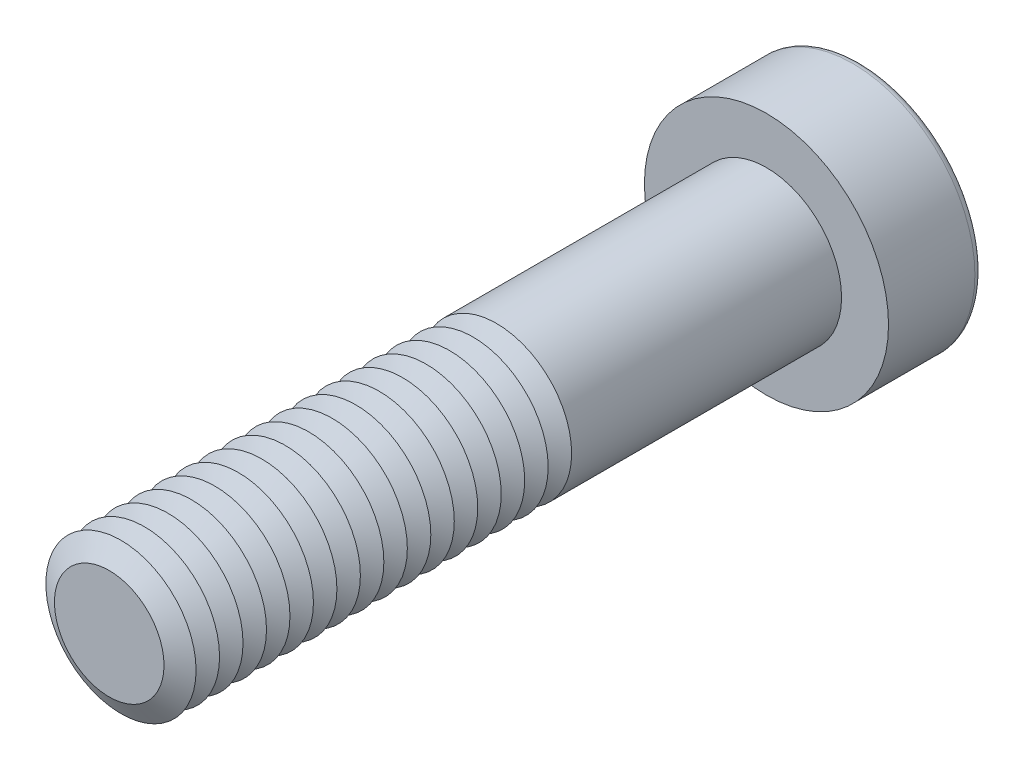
ISO-10303-21;
HEADER;
FILE_DESCRIPTION(('STEP AP214'),'2;1');
FILE_NAME('part.step','',(''),(''),'','','');
FILE_SCHEMA(('AUTOMOTIVE_DESIGN { 1 0 10303 214 1 1 1 1 }'));
ENDSEC;
DATA;
#1=APPLICATION_CONTEXT('core data for automotive mechanical design processes');
#2=APPLICATION_PROTOCOL_DEFINITION('international standard','automotive_design',2000,#1);
#3=PRODUCT_CONTEXT('',#1,'mechanical');
#4=PRODUCT('Part','Part','',(#3));
#5=PRODUCT_RELATED_PRODUCT_CATEGORY('part','',(#4));
#6=PRODUCT_DEFINITION_FORMATION('','',#4);
#7=PRODUCT_DEFINITION_CONTEXT('part definition',#1,'design');
#8=PRODUCT_DEFINITION('design','',#6,#7);
#9=PRODUCT_DEFINITION_SHAPE('','',#8);
#10=(LENGTH_UNIT() NAMED_UNIT(*) SI_UNIT(.MILLI.,.METRE.));
#11=(NAMED_UNIT(*) PLANE_ANGLE_UNIT() SI_UNIT($,.RADIAN.));
#12=(NAMED_UNIT(*) SI_UNIT($,.STERADIAN.) SOLID_ANGLE_UNIT());
#13=UNCERTAINTY_MEASURE_WITH_UNIT(LENGTH_MEASURE(1.E-05),#10,'distance_accuracy_value','');
#14=(GEOMETRIC_REPRESENTATION_CONTEXT(3) GLOBAL_UNCERTAINTY_ASSIGNED_CONTEXT((#13)) GLOBAL_UNIT_ASSIGNED_CONTEXT((#10,
#11,#12)) REPRESENTATION_CONTEXT('',''));
#15=CARTESIAN_POINT('',(0.,0.,0.));
#16=DIRECTION('',(0.,0.,1.));
#17=DIRECTION('',(1.,0.,0.));
#18=AXIS2_PLACEMENT_3D('',#15,#16,#17);
#19=CARTESIAN_POINT('',(0.,0.,30.625));
#20=DIRECTION('',(0.,0.,1.));
#21=DIRECTION('',(1.,0.,0.));
#22=AXIS2_PLACEMENT_3D('',#19,#20,#21);
#23=CONICAL_SURFACE('',#22,4.,1.0471975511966);
#24=CARTESIAN_POINT('',(0.,0.,30.));
#25=DIRECTION('',(0.,0.,1.));
#26=DIRECTION('',(1.,0.,0.));
#27=AXIS2_PLACEMENT_3D('',#24,#25,#26);
#28=CIRCLE('',#27,2.91746824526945);
#29=CARTESIAN_POINT('',(2.91746824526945,0.,30.));
#30=VERTEX_POINT('',#29);
#31=EDGE_CURVE('E313',#30,#30,#28,.T.);
#32=ORIENTED_EDGE('',*,*,#31,.T.);
#33=EDGE_LOOP('',(#32));
#34=FACE_BOUND('',#33,.T.);
#35=CARTESIAN_POINT('',(0.,0.,30.625));
#36=DIRECTION('',(0.,0.,1.));
#37=DIRECTION('',(1.,0.,0.));
#38=AXIS2_PLACEMENT_3D('',#35,#36,#37);
#39=CIRCLE('',#38,4.);
#40=CARTESIAN_POINT('',(4.,0.,30.625));
#41=VERTEX_POINT('',#40);
#42=EDGE_CURVE('E316',#41,#41,#39,.T.);
#43=ORIENTED_EDGE('',*,*,#42,.F.);
#44=EDGE_LOOP('',(#43));
#45=FACE_BOUND('',#44,.T.);
#46=ADVANCED_FACE('F39',(#34,#45),#23,.T.);
#47=CARTESIAN_POINT('',(0.,0.,30.));
#48=DIRECTION('',(0.,0.,-1.));
#49=DIRECTION('',(-1.,0.,0.));
#50=AXIS2_PLACEMENT_3D('',#47,#48,#49);
#51=CONICAL_SURFACE('',#50,2.91746824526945,1.0471975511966);
#52=CARTESIAN_POINT('',(0.,0.,29.375));
#53=DIRECTION('',(0.,0.,1.));
#54=DIRECTION('',(1.,0.,0.));
#55=AXIS2_PLACEMENT_3D('',#52,#53,#54);
#56=CIRCLE('',#55,4.);
#57=CARTESIAN_POINT('',(4.,0.,29.375));
#58=VERTEX_POINT('',#57);
#59=EDGE_CURVE('E324',#58,#58,#56,.T.);
#60=ORIENTED_EDGE('',*,*,#59,.T.);
#61=EDGE_LOOP('',(#60));
#62=FACE_BOUND('',#61,.T.);
#63=ORIENTED_EDGE('',*,*,#31,.F.);
#64=EDGE_LOOP('',(#63));
#65=FACE_BOUND('',#64,.T.);
#66=ADVANCED_FACE('F244',(#62,#65),#51,.T.);
#67=CARTESIAN_POINT('',(0.,0.,35.));
#68=DIRECTION('',(0.,0.,1.));
#69=DIRECTION('',(1.,0.,0.));
#70=AXIS2_PLACEMENT_3D('',#67,#68,#69);
#71=PLANE('',#70);
#72=CARTESIAN_POINT('',(0.,0.,35.));
#73=DIRECTION('',(0.,0.,1.));
#74=DIRECTION('',(1.,0.,0.));
#75=AXIS2_PLACEMENT_3D('',#72,#73,#74);
#76=CIRCLE('',#75,2.91746824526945);
#77=CARTESIAN_POINT('',(2.91746824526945,0.,35.));
#78=VERTEX_POINT('',#77);
#79=EDGE_CURVE('E174',#78,#78,#76,.T.);
#80=ORIENTED_EDGE('',*,*,#79,.T.);
#81=EDGE_LOOP('',(#80));
#82=FACE_BOUND('',#81,.T.);
#83=ADVANCED_FACE('F250',(#82),#71,.T.);
#84=CARTESIAN_POINT('',(0.,0.,35.));
#85=DIRECTION('',(0.,0.,-1.));
#86=DIRECTION('',(-1.,0.,0.));
#87=AXIS2_PLACEMENT_3D('',#84,#85,#86);
#88=CONICAL_SURFACE('',#87,2.91746824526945,1.0471975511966);
#89=CARTESIAN_POINT('',(0.,0.,34.375));
#90=DIRECTION('',(0.,0.,1.));
#91=DIRECTION('',(1.,0.,0.));
#92=AXIS2_PLACEMENT_3D('',#89,#90,#91);
#93=CIRCLE('',#92,4.);
#94=CARTESIAN_POINT('',(4.,0.,34.375));
#95=VERTEX_POINT('',#94);
#96=EDGE_CURVE('E290',#95,#95,#93,.T.);
#97=ORIENTED_EDGE('',*,*,#96,.T.);
#98=EDGE_LOOP('',(#97));
#99=FACE_BOUND('',#98,.T.);
#100=ORIENTED_EDGE('',*,*,#79,.F.);
#101=EDGE_LOOP('',(#100));
#102=FACE_BOUND('',#101,.T.);
#103=ADVANCED_FACE('F199',(#99,#102),#88,.T.);
#104=CARTESIAN_POINT('',(0.,0.,34.375));
#105=DIRECTION('',(0.,0.,1.));
#106=DIRECTION('',(1.,0.,0.));
#107=AXIS2_PLACEMENT_3D('',#104,#105,#106);
#108=CONICAL_SURFACE('',#107,4.,1.0471975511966);
#109=CARTESIAN_POINT('',(0.,0.,33.75));
#110=DIRECTION('',(0.,0.,1.));
#111=DIRECTION('',(1.,0.,0.));
#112=AXIS2_PLACEMENT_3D('',#109,#110,#111);
#113=CIRCLE('',#112,2.91746824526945);
#114=CARTESIAN_POINT('',(2.91746824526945,0.,33.75));
#115=VERTEX_POINT('',#114);
#116=EDGE_CURVE('E287',#115,#115,#113,.T.);
#117=ORIENTED_EDGE('',*,*,#116,.T.);
#118=EDGE_LOOP('',(#117));
#119=FACE_BOUND('',#118,.T.);
#120=ORIENTED_EDGE('',*,*,#96,.F.);
#121=EDGE_LOOP('',(#120));
#122=FACE_BOUND('',#121,.T.);
#123=ADVANCED_FACE('F276',(#119,#122),#108,.T.);
#124=CARTESIAN_POINT('',(0.,0.,33.75));
#125=DIRECTION('',(0.,0.,-1.));
#126=DIRECTION('',(-1.,0.,0.));
#127=AXIS2_PLACEMENT_3D('',#124,#125,#126);
#128=CONICAL_SURFACE('',#127,2.91746824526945,1.0471975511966);
#129=CARTESIAN_POINT('',(0.,0.,33.125));
#130=DIRECTION('',(0.,0.,1.));
#131=DIRECTION('',(1.,0.,0.));
#132=AXIS2_PLACEMENT_3D('',#129,#130,#131);
#133=CIRCLE('',#132,4.);
#134=CARTESIAN_POINT('',(4.,0.,33.125));
#135=VERTEX_POINT('',#134);
#136=EDGE_CURVE('E299',#135,#135,#133,.T.);
#137=ORIENTED_EDGE('',*,*,#136,.T.);
#138=EDGE_LOOP('',(#137));
#139=FACE_BOUND('',#138,.T.);
#140=ORIENTED_EDGE('',*,*,#116,.F.);
#141=EDGE_LOOP('',(#140));
#142=FACE_BOUND('',#141,.T.);
#143=ADVANCED_FACE('F273',(#139,#142),#128,.T.);
#144=CARTESIAN_POINT('',(0.,0.,33.125));
#145=DIRECTION('',(0.,0.,1.));
#146=DIRECTION('',(1.,0.,0.));
#147=AXIS2_PLACEMENT_3D('',#144,#145,#146);
#148=CONICAL_SURFACE('',#147,4.,1.0471975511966);
#149=CARTESIAN_POINT('',(0.,0.,32.5));
#150=DIRECTION('',(0.,0.,1.));
#151=DIRECTION('',(1.,0.,0.));
#152=AXIS2_PLACEMENT_3D('',#149,#150,#151);
#153=CIRCLE('',#152,2.91746824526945);
#154=CARTESIAN_POINT('',(2.91746824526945,0.,32.5));
#155=VERTEX_POINT('',#154);
#156=EDGE_CURVE('E292',#155,#155,#153,.T.);
#157=ORIENTED_EDGE('',*,*,#156,.T.);
#158=EDGE_LOOP('',(#157));
#159=FACE_BOUND('',#158,.T.);
#160=ORIENTED_EDGE('',*,*,#136,.F.);
#161=EDGE_LOOP('',(#160));
#162=FACE_BOUND('',#161,.T.);
#163=ADVANCED_FACE('F269',(#159,#162),#148,.T.);
#164=CARTESIAN_POINT('',(0.,0.,32.5));
#165=DIRECTION('',(0.,0.,-1.));
#166=DIRECTION('',(-1.,0.,0.));
#167=AXIS2_PLACEMENT_3D('',#164,#165,#166);
#168=CONICAL_SURFACE('',#167,2.91746824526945,1.0471975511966);
#169=CARTESIAN_POINT('',(0.,0.,31.875));
#170=DIRECTION('',(0.,0.,1.));
#171=DIRECTION('',(1.,0.,0.));
#172=AXIS2_PLACEMENT_3D('',#169,#170,#171);
#173=CIRCLE('',#172,4.);
#174=CARTESIAN_POINT('',(4.,0.,31.875));
#175=VERTEX_POINT('',#174);
#176=EDGE_CURVE('E309',#175,#175,#173,.T.);
#177=ORIENTED_EDGE('',*,*,#176,.T.);
#178=EDGE_LOOP('',(#177));
#179=FACE_BOUND('',#178,.T.);
#180=ORIENTED_EDGE('',*,*,#156,.F.);
#181=EDGE_LOOP('',(#180));
#182=FACE_BOUND('',#181,.T.);
#183=ADVANCED_FACE('F265',(#179,#182),#168,.T.);
#184=CARTESIAN_POINT('',(0.,0.,31.875));
#185=DIRECTION('',(0.,0.,1.));
#186=DIRECTION('',(1.,0.,0.));
#187=AXIS2_PLACEMENT_3D('',#184,#185,#186);
#188=CONICAL_SURFACE('',#187,4.,1.0471975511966);
#189=CARTESIAN_POINT('',(0.,0.,31.25));
#190=DIRECTION('',(0.,0.,1.));
#191=DIRECTION('',(1.,0.,0.));
#192=AXIS2_PLACEMENT_3D('',#189,#190,#191);
#193=CIRCLE('',#192,2.91746824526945);
#194=CARTESIAN_POINT('',(2.91746824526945,0.,31.25));
#195=VERTEX_POINT('',#194);
#196=EDGE_CURVE('E305',#195,#195,#193,.T.);
#197=ORIENTED_EDGE('',*,*,#196,.T.);
#198=EDGE_LOOP('',(#197));
#199=FACE_BOUND('',#198,.T.);
#200=ORIENTED_EDGE('',*,*,#176,.F.);
#201=EDGE_LOOP('',(#200));
#202=FACE_BOUND('',#201,.T.);
#203=ADVANCED_FACE('F261',(#199,#202),#188,.T.);
#204=CARTESIAN_POINT('',(0.,0.,31.25));
#205=DIRECTION('',(0.,0.,-1.));
#206=DIRECTION('',(-1.,0.,0.));
#207=AXIS2_PLACEMENT_3D('',#204,#205,#206);
#208=CONICAL_SURFACE('',#207,2.91746824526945,1.0471975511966);
#209=ORIENTED_EDGE('',*,*,#42,.T.);
#210=EDGE_LOOP('',(#209));
#211=FACE_BOUND('',#210,.T.);
#212=ORIENTED_EDGE('',*,*,#196,.F.);
#213=EDGE_LOOP('',(#212));
#214=FACE_BOUND('',#213,.T.);
#215=ADVANCED_FACE('F257',(#211,#214),#208,.T.);
#216=CARTESIAN_POINT('',(0.,0.,29.375));
#217=DIRECTION('',(0.,0.,1.));
#218=DIRECTION('',(1.,0.,0.));
#219=AXIS2_PLACEMENT_3D('',#216,#217,#218);
#220=CONICAL_SURFACE('',#219,4.,1.0471975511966);
#221=CARTESIAN_POINT('',(0.,0.,28.75));
#222=DIRECTION('',(0.,0.,1.));
#223=DIRECTION('',(1.,0.,0.));
#224=AXIS2_PLACEMENT_3D('',#221,#222,#223);
#225=CIRCLE('',#224,2.91746824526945);
#226=CARTESIAN_POINT('',(2.91746824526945,0.,28.75));
#227=VERTEX_POINT('',#226);
#228=EDGE_CURVE('E320',#227,#227,#225,.T.);
#229=ORIENTED_EDGE('',*,*,#228,.T.);
#230=EDGE_LOOP('',(#229));
#231=FACE_BOUND('',#230,.T.);
#232=ORIENTED_EDGE('',*,*,#59,.F.);
#233=EDGE_LOOP('',(#232));
#234=FACE_BOUND('',#233,.T.);
#235=ADVANCED_FACE('F260',(#231,#234),#220,.T.);
#236=CARTESIAN_POINT('',(0.,0.,28.75));
#237=DIRECTION('',(0.,0.,-1.));
#238=DIRECTION('',(-1.,0.,0.));
#239=AXIS2_PLACEMENT_3D('',#236,#237,#238);
#240=CONICAL_SURFACE('',#239,2.91746824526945,1.0471975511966);
#241=CARTESIAN_POINT('',(0.,0.,28.125));
#242=DIRECTION('',(0.,0.,1.));
#243=DIRECTION('',(1.,0.,0.));
#244=AXIS2_PLACEMENT_3D('',#241,#242,#243);
#245=CIRCLE('',#244,4.);
#246=CARTESIAN_POINT('',(4.,0.,28.125));
#247=VERTEX_POINT('',#246);
#248=EDGE_CURVE('E332',#247,#247,#245,.T.);
#249=ORIENTED_EDGE('',*,*,#248,.T.);
#250=EDGE_LOOP('',(#249));
#251=FACE_BOUND('',#250,.T.);
#252=ORIENTED_EDGE('',*,*,#228,.F.);
#253=EDGE_LOOP('',(#252));
#254=FACE_BOUND('',#253,.T.);
#255=ADVANCED_FACE('F512',(#251,#254),#240,.T.);
#256=CARTESIAN_POINT('',(0.,0.,28.125));
#257=DIRECTION('',(0.,0.,1.));
#258=DIRECTION('',(1.,0.,0.));
#259=AXIS2_PLACEMENT_3D('',#256,#257,#258);
#260=CONICAL_SURFACE('',#259,4.,1.0471975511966);
#261=CARTESIAN_POINT('',(0.,0.,27.5));
#262=DIRECTION('',(0.,0.,1.));
#263=DIRECTION('',(1.,0.,0.));
#264=AXIS2_PLACEMENT_3D('',#261,#262,#263);
#265=CIRCLE('',#264,2.91746824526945);
#266=CARTESIAN_POINT('',(2.91746824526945,0.,27.5));
#267=VERTEX_POINT('',#266);
#268=EDGE_CURVE('E328',#267,#267,#265,.T.);
#269=ORIENTED_EDGE('',*,*,#268,.T.);
#270=EDGE_LOOP('',(#269));
#271=FACE_BOUND('',#270,.T.);
#272=ORIENTED_EDGE('',*,*,#248,.F.);
#273=EDGE_LOOP('',(#272));
#274=FACE_BOUND('',#273,.T.);
#275=ADVANCED_FACE('F508',(#271,#274),#260,.T.);
#276=CARTESIAN_POINT('',(0.,0.,27.5));
#277=DIRECTION('',(0.,0.,-1.));
#278=DIRECTION('',(-1.,0.,0.));
#279=AXIS2_PLACEMENT_3D('',#276,#277,#278);
#280=CONICAL_SURFACE('',#279,2.91746824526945,1.0471975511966);
#281=CARTESIAN_POINT('',(0.,0.,26.875));
#282=DIRECTION('',(0.,0.,1.));
#283=DIRECTION('',(1.,0.,0.));
#284=AXIS2_PLACEMENT_3D('',#281,#282,#283);
#285=CIRCLE('',#284,4.);
#286=CARTESIAN_POINT('',(4.,0.,26.875));
#287=VERTEX_POINT('',#286);
#288=EDGE_CURVE('E340',#287,#287,#285,.T.);
#289=ORIENTED_EDGE('',*,*,#288,.T.);
#290=EDGE_LOOP('',(#289));
#291=FACE_BOUND('',#290,.T.);
#292=ORIENTED_EDGE('',*,*,#268,.F.);
#293=EDGE_LOOP('',(#292));
#294=FACE_BOUND('',#293,.T.);
#295=ADVANCED_FACE('F504',(#291,#294),#280,.T.);
#296=CARTESIAN_POINT('',(0.,0.,26.875));
#297=DIRECTION('',(0.,0.,1.));
#298=DIRECTION('',(1.,0.,0.));
#299=AXIS2_PLACEMENT_3D('',#296,#297,#298);
#300=CONICAL_SURFACE('',#299,4.,1.0471975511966);
#301=CARTESIAN_POINT('',(0.,0.,26.25));
#302=DIRECTION('',(0.,0.,1.));
#303=DIRECTION('',(1.,0.,0.));
#304=AXIS2_PLACEMENT_3D('',#301,#302,#303);
#305=CIRCLE('',#304,2.91746824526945);
#306=CARTESIAN_POINT('',(2.91746824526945,0.,26.25));
#307=VERTEX_POINT('',#306);
#308=EDGE_CURVE('E336',#307,#307,#305,.T.);
#309=ORIENTED_EDGE('',*,*,#308,.T.);
#310=EDGE_LOOP('',(#309));
#311=FACE_BOUND('',#310,.T.);
#312=ORIENTED_EDGE('',*,*,#288,.F.);
#313=EDGE_LOOP('',(#312));
#314=FACE_BOUND('',#313,.T.);
#315=ADVANCED_FACE('F500',(#311,#314),#300,.T.);
#316=CARTESIAN_POINT('',(0.,0.,26.25));
#317=DIRECTION('',(0.,0.,-1.));
#318=DIRECTION('',(-1.,0.,0.));
#319=AXIS2_PLACEMENT_3D('',#316,#317,#318);
#320=CONICAL_SURFACE('',#319,2.91746824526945,1.0471975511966);
#321=CARTESIAN_POINT('',(0.,0.,25.625));
#322=DIRECTION('',(0.,0.,1.));
#323=DIRECTION('',(1.,0.,0.));
#324=AXIS2_PLACEMENT_3D('',#321,#322,#323);
#325=CIRCLE('',#324,4.);
#326=CARTESIAN_POINT('',(4.,0.,25.625));
#327=VERTEX_POINT('',#326);
#328=EDGE_CURVE('E348',#327,#327,#325,.T.);
#329=ORIENTED_EDGE('',*,*,#328,.T.);
#330=EDGE_LOOP('',(#329));
#331=FACE_BOUND('',#330,.T.);
#332=ORIENTED_EDGE('',*,*,#308,.F.);
#333=EDGE_LOOP('',(#332));
#334=FACE_BOUND('',#333,.T.);
#335=ADVANCED_FACE('F496',(#331,#334),#320,.T.);
#336=CARTESIAN_POINT('',(0.,0.,25.625));
#337=DIRECTION('',(0.,0.,1.));
#338=DIRECTION('',(1.,0.,0.));
#339=AXIS2_PLACEMENT_3D('',#336,#337,#338);
#340=CONICAL_SURFACE('',#339,4.,1.0471975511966);
#341=CARTESIAN_POINT('',(0.,0.,25.));
#342=DIRECTION('',(0.,0.,1.));
#343=DIRECTION('',(1.,0.,0.));
#344=AXIS2_PLACEMENT_3D('',#341,#342,#343);
#345=CIRCLE('',#344,2.91746824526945);
#346=CARTESIAN_POINT('',(2.91746824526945,0.,25.));
#347=VERTEX_POINT('',#346);
#348=EDGE_CURVE('E344',#347,#347,#345,.T.);
#349=ORIENTED_EDGE('',*,*,#348,.T.);
#350=EDGE_LOOP('',(#349));
#351=FACE_BOUND('',#350,.T.);
#352=ORIENTED_EDGE('',*,*,#328,.F.);
#353=EDGE_LOOP('',(#352));
#354=FACE_BOUND('',#353,.T.);
#355=ADVANCED_FACE('F492',(#351,#354),#340,.T.);
#356=CARTESIAN_POINT('',(0.,0.,25.));
#357=DIRECTION('',(0.,0.,-1.));
#358=DIRECTION('',(-1.,0.,0.));
#359=AXIS2_PLACEMENT_3D('',#356,#357,#358);
#360=CONICAL_SURFACE('',#359,2.91746824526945,1.0471975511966);
#361=CARTESIAN_POINT('',(0.,0.,24.375));
#362=DIRECTION('',(0.,0.,1.));
#363=DIRECTION('',(1.,0.,0.));
#364=AXIS2_PLACEMENT_3D('',#361,#362,#363);
#365=CIRCLE('',#364,4.);
#366=CARTESIAN_POINT('',(4.,0.,24.375));
#367=VERTEX_POINT('',#366);
#368=EDGE_CURVE('E356',#367,#367,#365,.T.);
#369=ORIENTED_EDGE('',*,*,#368,.T.);
#370=EDGE_LOOP('',(#369));
#371=FACE_BOUND('',#370,.T.);
#372=ORIENTED_EDGE('',*,*,#348,.F.);
#373=EDGE_LOOP('',(#372));
#374=FACE_BOUND('',#373,.T.);
#375=ADVANCED_FACE('F488',(#371,#374),#360,.T.);
#376=CARTESIAN_POINT('',(0.,0.,24.375));
#377=DIRECTION('',(0.,0.,1.));
#378=DIRECTION('',(1.,0.,0.));
#379=AXIS2_PLACEMENT_3D('',#376,#377,#378);
#380=CONICAL_SURFACE('',#379,4.,1.0471975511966);
#381=CARTESIAN_POINT('',(0.,0.,23.75));
#382=DIRECTION('',(0.,0.,1.));
#383=DIRECTION('',(1.,0.,0.));
#384=AXIS2_PLACEMENT_3D('',#381,#382,#383);
#385=CIRCLE('',#384,2.91746824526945);
#386=CARTESIAN_POINT('',(2.91746824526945,0.,23.75));
#387=VERTEX_POINT('',#386);
#388=EDGE_CURVE('E352',#387,#387,#385,.T.);
#389=ORIENTED_EDGE('',*,*,#388,.T.);
#390=EDGE_LOOP('',(#389));
#391=FACE_BOUND('',#390,.T.);
#392=ORIENTED_EDGE('',*,*,#368,.F.);
#393=EDGE_LOOP('',(#392));
#394=FACE_BOUND('',#393,.T.);
#395=ADVANCED_FACE('F484',(#391,#394),#380,.T.);
#396=CARTESIAN_POINT('',(0.,0.,23.75));
#397=DIRECTION('',(0.,0.,-1.));
#398=DIRECTION('',(-1.,0.,0.));
#399=AXIS2_PLACEMENT_3D('',#396,#397,#398);
#400=CONICAL_SURFACE('',#399,2.91746824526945,1.0471975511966);
#401=CARTESIAN_POINT('',(0.,0.,23.125));
#402=DIRECTION('',(0.,0.,1.));
#403=DIRECTION('',(1.,0.,0.));
#404=AXIS2_PLACEMENT_3D('',#401,#402,#403);
#405=CIRCLE('',#404,4.);
#406=CARTESIAN_POINT('',(4.,0.,23.125));
#407=VERTEX_POINT('',#406);
#408=EDGE_CURVE('E364',#407,#407,#405,.T.);
#409=ORIENTED_EDGE('',*,*,#408,.T.);
#410=EDGE_LOOP('',(#409));
#411=FACE_BOUND('',#410,.T.);
#412=ORIENTED_EDGE('',*,*,#388,.F.);
#413=EDGE_LOOP('',(#412));
#414=FACE_BOUND('',#413,.T.);
#415=ADVANCED_FACE('F480',(#411,#414),#400,.T.);
#416=CARTESIAN_POINT('',(0.,0.,23.125));
#417=DIRECTION('',(0.,0.,1.));
#418=DIRECTION('',(1.,0.,0.));
#419=AXIS2_PLACEMENT_3D('',#416,#417,#418);
#420=CONICAL_SURFACE('',#419,4.,1.0471975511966);
#421=CARTESIAN_POINT('',(0.,0.,22.5));
#422=DIRECTION('',(0.,0.,1.));
#423=DIRECTION('',(1.,0.,0.));
#424=AXIS2_PLACEMENT_3D('',#421,#422,#423);
#425=CIRCLE('',#424,2.91746824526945);
#426=CARTESIAN_POINT('',(2.91746824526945,0.,22.5));
#427=VERTEX_POINT('',#426);
#428=EDGE_CURVE('E360',#427,#427,#425,.T.);
#429=ORIENTED_EDGE('',*,*,#428,.T.);
#430=EDGE_LOOP('',(#429));
#431=FACE_BOUND('',#430,.T.);
#432=ORIENTED_EDGE('',*,*,#408,.F.);
#433=EDGE_LOOP('',(#432));
#434=FACE_BOUND('',#433,.T.);
#435=ADVANCED_FACE('F476',(#431,#434),#420,.T.);
#436=CARTESIAN_POINT('',(0.,0.,22.5));
#437=DIRECTION('',(0.,0.,-1.));
#438=DIRECTION('',(-1.,0.,0.));
#439=AXIS2_PLACEMENT_3D('',#436,#437,#438);
#440=CONICAL_SURFACE('',#439,2.91746824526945,1.0471975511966);
#441=CARTESIAN_POINT('',(0.,0.,21.875));
#442=DIRECTION('',(0.,0.,1.));
#443=DIRECTION('',(1.,0.,0.));
#444=AXIS2_PLACEMENT_3D('',#441,#442,#443);
#445=CIRCLE('',#444,4.);
#446=CARTESIAN_POINT('',(4.,0.,21.875));
#447=VERTEX_POINT('',#446);
#448=EDGE_CURVE('E372',#447,#447,#445,.T.);
#449=ORIENTED_EDGE('',*,*,#448,.T.);
#450=EDGE_LOOP('',(#449));
#451=FACE_BOUND('',#450,.T.);
#452=ORIENTED_EDGE('',*,*,#428,.F.);
#453=EDGE_LOOP('',(#452));
#454=FACE_BOUND('',#453,.T.);
#455=ADVANCED_FACE('F472',(#451,#454),#440,.T.);
#456=CARTESIAN_POINT('',(0.,0.,21.875));
#457=DIRECTION('',(0.,0.,1.));
#458=DIRECTION('',(1.,0.,0.));
#459=AXIS2_PLACEMENT_3D('',#456,#457,#458);
#460=CONICAL_SURFACE('',#459,4.,1.0471975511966);
#461=CARTESIAN_POINT('',(0.,0.,21.25));
#462=DIRECTION('',(0.,0.,1.));
#463=DIRECTION('',(1.,0.,0.));
#464=AXIS2_PLACEMENT_3D('',#461,#462,#463);
#465=CIRCLE('',#464,2.91746824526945);
#466=CARTESIAN_POINT('',(2.91746824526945,0.,21.25));
#467=VERTEX_POINT('',#466);
#468=EDGE_CURVE('E368',#467,#467,#465,.T.);
#469=ORIENTED_EDGE('',*,*,#468,.T.);
#470=EDGE_LOOP('',(#469));
#471=FACE_BOUND('',#470,.T.);
#472=ORIENTED_EDGE('',*,*,#448,.F.);
#473=EDGE_LOOP('',(#472));
#474=FACE_BOUND('',#473,.T.);
#475=ADVANCED_FACE('F468',(#471,#474),#460,.T.);
#476=CARTESIAN_POINT('',(0.,0.,21.25));
#477=DIRECTION('',(0.,0.,-1.));
#478=DIRECTION('',(-1.,0.,0.));
#479=AXIS2_PLACEMENT_3D('',#476,#477,#478);
#480=CONICAL_SURFACE('',#479,2.91746824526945,1.0471975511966);
#481=CARTESIAN_POINT('',(0.,0.,20.625));
#482=DIRECTION('',(0.,0.,1.));
#483=DIRECTION('',(1.,0.,0.));
#484=AXIS2_PLACEMENT_3D('',#481,#482,#483);
#485=CIRCLE('',#484,4.);
#486=CARTESIAN_POINT('',(4.,0.,20.625));
#487=VERTEX_POINT('',#486);
#488=EDGE_CURVE('E380',#487,#487,#485,.T.);
#489=ORIENTED_EDGE('',*,*,#488,.T.);
#490=EDGE_LOOP('',(#489));
#491=FACE_BOUND('',#490,.T.);
#492=ORIENTED_EDGE('',*,*,#468,.F.);
#493=EDGE_LOOP('',(#492));
#494=FACE_BOUND('',#493,.T.);
#495=ADVANCED_FACE('F464',(#491,#494),#480,.T.);
#496=CARTESIAN_POINT('',(0.,0.,20.625));
#497=DIRECTION('',(0.,0.,1.));
#498=DIRECTION('',(1.,0.,0.));
#499=AXIS2_PLACEMENT_3D('',#496,#497,#498);
#500=CONICAL_SURFACE('',#499,4.,1.0471975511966);
#501=CARTESIAN_POINT('',(0.,0.,20.));
#502=DIRECTION('',(0.,0.,1.));
#503=DIRECTION('',(1.,0.,0.));
#504=AXIS2_PLACEMENT_3D('',#501,#502,#503);
#505=CIRCLE('',#504,2.91746824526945);
#506=CARTESIAN_POINT('',(2.91746824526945,0.,20.));
#507=VERTEX_POINT('',#506);
#508=EDGE_CURVE('E376',#507,#507,#505,.T.);
#509=ORIENTED_EDGE('',*,*,#508,.T.);
#510=EDGE_LOOP('',(#509));
#511=FACE_BOUND('',#510,.T.);
#512=ORIENTED_EDGE('',*,*,#488,.F.);
#513=EDGE_LOOP('',(#512));
#514=FACE_BOUND('',#513,.T.);
#515=ADVANCED_FACE('F460',(#511,#514),#500,.T.);
#516=CARTESIAN_POINT('',(0.,0.,20.));
#517=DIRECTION('',(0.,0.,-1.));
#518=DIRECTION('',(-1.,0.,0.));
#519=AXIS2_PLACEMENT_3D('',#516,#517,#518);
#520=CONICAL_SURFACE('',#519,2.91746824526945,1.0471975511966);
#521=CARTESIAN_POINT('',(0.,0.,19.375));
#522=DIRECTION('',(0.,0.,1.));
#523=DIRECTION('',(1.,0.,0.));
#524=AXIS2_PLACEMENT_3D('',#521,#522,#523);
#525=CIRCLE('',#524,4.);
#526=CARTESIAN_POINT('',(4.,0.,19.375));
#527=VERTEX_POINT('',#526);
#528=EDGE_CURVE('E388',#527,#527,#525,.T.);
#529=ORIENTED_EDGE('',*,*,#528,.T.);
#530=EDGE_LOOP('',(#529));
#531=FACE_BOUND('',#530,.T.);
#532=ORIENTED_EDGE('',*,*,#508,.F.);
#533=EDGE_LOOP('',(#532));
#534=FACE_BOUND('',#533,.T.);
#535=ADVANCED_FACE('F456',(#531,#534),#520,.T.);
#536=CARTESIAN_POINT('',(0.,0.,19.375));
#537=DIRECTION('',(0.,0.,1.));
#538=DIRECTION('',(1.,0.,0.));
#539=AXIS2_PLACEMENT_3D('',#536,#537,#538);
#540=CONICAL_SURFACE('',#539,4.,1.0471975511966);
#541=CARTESIAN_POINT('',(0.,0.,18.75));
#542=DIRECTION('',(0.,0.,1.));
#543=DIRECTION('',(1.,0.,0.));
#544=AXIS2_PLACEMENT_3D('',#541,#542,#543);
#545=CIRCLE('',#544,2.91746824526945);
#546=CARTESIAN_POINT('',(2.91746824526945,0.,18.75));
#547=VERTEX_POINT('',#546);
#548=EDGE_CURVE('E384',#547,#547,#545,.T.);
#549=ORIENTED_EDGE('',*,*,#548,.T.);
#550=EDGE_LOOP('',(#549));
#551=FACE_BOUND('',#550,.T.);
#552=ORIENTED_EDGE('',*,*,#528,.F.);
#553=EDGE_LOOP('',(#552));
#554=FACE_BOUND('',#553,.T.);
#555=ADVANCED_FACE('F452',(#551,#554),#540,.T.);
#556=CARTESIAN_POINT('',(0.,0.,18.75));
#557=DIRECTION('',(0.,0.,-1.));
#558=DIRECTION('',(-1.,0.,0.));
#559=AXIS2_PLACEMENT_3D('',#556,#557,#558);
#560=CONICAL_SURFACE('',#559,2.91746824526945,1.0471975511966);
#561=CARTESIAN_POINT('',(0.,0.,18.125));
#562=DIRECTION('',(0.,0.,1.));
#563=DIRECTION('',(1.,0.,0.));
#564=AXIS2_PLACEMENT_3D('',#561,#562,#563);
#565=CIRCLE('',#564,4.);
#566=CARTESIAN_POINT('',(4.,0.,18.125));
#567=VERTEX_POINT('',#566);
#568=EDGE_CURVE('E396',#567,#567,#565,.T.);
#569=ORIENTED_EDGE('',*,*,#568,.T.);
#570=EDGE_LOOP('',(#569));
#571=FACE_BOUND('',#570,.T.);
#572=ORIENTED_EDGE('',*,*,#548,.F.);
#573=EDGE_LOOP('',(#572));
#574=FACE_BOUND('',#573,.T.);
#575=ADVANCED_FACE('F448',(#571,#574),#560,.T.);
#576=CARTESIAN_POINT('',(0.,0.,18.125));
#577=DIRECTION('',(0.,0.,1.));
#578=DIRECTION('',(1.,0.,0.));
#579=AXIS2_PLACEMENT_3D('',#576,#577,#578);
#580=CONICAL_SURFACE('',#579,4.,1.0471975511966);
#581=CARTESIAN_POINT('',(0.,0.,17.5));
#582=DIRECTION('',(0.,0.,1.));
#583=DIRECTION('',(1.,0.,0.));
#584=AXIS2_PLACEMENT_3D('',#581,#582,#583);
#585=CIRCLE('',#584,2.91746824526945);
#586=CARTESIAN_POINT('',(2.91746824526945,0.,17.5));
#587=VERTEX_POINT('',#586);
#588=EDGE_CURVE('E392',#587,#587,#585,.T.);
#589=ORIENTED_EDGE('',*,*,#588,.T.);
#590=EDGE_LOOP('',(#589));
#591=FACE_BOUND('',#590,.T.);
#592=ORIENTED_EDGE('',*,*,#568,.F.);
#593=EDGE_LOOP('',(#592));
#594=FACE_BOUND('',#593,.T.);
#595=ADVANCED_FACE('F444',(#591,#594),#580,.T.);
#596=CARTESIAN_POINT('',(0.,0.,17.5));
#597=DIRECTION('',(0.,0.,-1.));
#598=DIRECTION('',(-1.,0.,0.));
#599=AXIS2_PLACEMENT_3D('',#596,#597,#598);
#600=CONICAL_SURFACE('',#599,2.91746824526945,1.0471975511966);
#601=CARTESIAN_POINT('',(0.,0.,16.875));
#602=DIRECTION('',(0.,0.,1.));
#603=DIRECTION('',(1.,0.,0.));
#604=AXIS2_PLACEMENT_3D('',#601,#602,#603);
#605=CIRCLE('',#604,4.);
#606=CARTESIAN_POINT('',(4.,0.,16.875));
#607=VERTEX_POINT('',#606);
#608=EDGE_CURVE('E404',#607,#607,#605,.T.);
#609=ORIENTED_EDGE('',*,*,#608,.T.);
#610=EDGE_LOOP('',(#609));
#611=FACE_BOUND('',#610,.T.);
#612=ORIENTED_EDGE('',*,*,#588,.F.);
#613=EDGE_LOOP('',(#612));
#614=FACE_BOUND('',#613,.T.);
#615=ADVANCED_FACE('F440',(#611,#614),#600,.T.);
#616=CARTESIAN_POINT('',(0.,0.,16.875));
#617=DIRECTION('',(0.,0.,1.));
#618=DIRECTION('',(1.,0.,0.));
#619=AXIS2_PLACEMENT_3D('',#616,#617,#618);
#620=CONICAL_SURFACE('',#619,4.,1.0471975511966);
#621=CARTESIAN_POINT('',(0.,0.,16.25));
#622=DIRECTION('',(0.,0.,1.));
#623=DIRECTION('',(1.,0.,0.));
#624=AXIS2_PLACEMENT_3D('',#621,#622,#623);
#625=CIRCLE('',#624,2.91746824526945);
#626=CARTESIAN_POINT('',(2.91746824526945,0.,16.25));
#627=VERTEX_POINT('',#626);
#628=EDGE_CURVE('E400',#627,#627,#625,.T.);
#629=ORIENTED_EDGE('',*,*,#628,.T.);
#630=EDGE_LOOP('',(#629));
#631=FACE_BOUND('',#630,.T.);
#632=ORIENTED_EDGE('',*,*,#608,.F.);
#633=EDGE_LOOP('',(#632));
#634=FACE_BOUND('',#633,.T.);
#635=ADVANCED_FACE('F435',(#631,#634),#620,.T.);
#636=CARTESIAN_POINT('',(0.,0.,16.25));
#637=DIRECTION('',(0.,0.,-1.));
#638=DIRECTION('',(-1.,0.,0.));
#639=AXIS2_PLACEMENT_3D('',#636,#637,#638);
#640=CONICAL_SURFACE('',#639,2.91746824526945,1.0471975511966);
#641=CARTESIAN_POINT('',(0.,0.,15.625));
#642=DIRECTION('',(0.,0.,1.));
#643=DIRECTION('',(1.,0.,0.));
#644=AXIS2_PLACEMENT_3D('',#641,#642,#643);
#645=CIRCLE('',#644,4.);
#646=CARTESIAN_POINT('',(4.,0.,15.625));
#647=VERTEX_POINT('',#646);
#648=EDGE_CURVE('E416',#647,#647,#645,.T.);
#649=ORIENTED_EDGE('',*,*,#648,.T.);
#650=EDGE_LOOP('',(#649));
#651=FACE_BOUND('',#650,.T.);
#652=ORIENTED_EDGE('',*,*,#628,.F.);
#653=EDGE_LOOP('',(#652));
#654=FACE_BOUND('',#653,.T.);
#655=ADVANCED_FACE('F421',(#651,#654),#640,.T.);
#656=CARTESIAN_POINT('',(0.,0.,15.625));
#657=DIRECTION('',(0.,0.,1.));
#658=DIRECTION('',(1.,0.,0.));
#659=AXIS2_PLACEMENT_3D('',#656,#657,#658);
#660=CONICAL_SURFACE('',#659,4.,1.0471975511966);
#661=CARTESIAN_POINT('',(0.,0.,15.));
#662=DIRECTION('',(0.,0.,1.));
#663=DIRECTION('',(1.,0.,0.));
#664=AXIS2_PLACEMENT_3D('',#661,#662,#663);
#665=CIRCLE('',#664,2.91746824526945);
#666=CARTESIAN_POINT('',(2.91746824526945,0.,15.));
#667=VERTEX_POINT('',#666);
#668=EDGE_CURVE('E408',#667,#667,#665,.T.);
#669=ORIENTED_EDGE('',*,*,#668,.T.);
#670=EDGE_LOOP('',(#669));
#671=FACE_BOUND('',#670,.T.);
#672=ORIENTED_EDGE('',*,*,#648,.F.);
#673=EDGE_LOOP('',(#672));
#674=FACE_BOUND('',#673,.T.);
#675=ADVANCED_FACE('F424',(#671,#674),#660,.T.);
#676=CARTESIAN_POINT('',(0.,0.,15.));
#677=DIRECTION('',(0.,0.,-1.));
#678=DIRECTION('',(-1.,0.,0.));
#679=AXIS2_PLACEMENT_3D('',#676,#677,#678);
#680=CONICAL_SURFACE('',#679,2.91746824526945,1.0471975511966);
#681=CARTESIAN_POINT('',(0.,0.,14.375));
#682=DIRECTION('',(0.,0.,1.));
#683=DIRECTION('',(1.,0.,0.));
#684=AXIS2_PLACEMENT_3D('',#681,#682,#683);
#685=CIRCLE('',#684,4.);
#686=CARTESIAN_POINT('',(4.,0.,14.375));
#687=VERTEX_POINT('',#686);
#688=EDGE_CURVE('E412',#687,#687,#685,.T.);
#689=ORIENTED_EDGE('',*,*,#688,.T.);
#690=EDGE_LOOP('',(#689));
#691=FACE_BOUND('',#690,.T.);
#692=ORIENTED_EDGE('',*,*,#668,.F.);
#693=EDGE_LOOP('',(#692));
#694=FACE_BOUND('',#693,.T.);
#695=ADVANCED_FACE('F426',(#691,#694),#680,.T.);
#696=CARTESIAN_POINT('',(0.,0.,-1.25));
#697=DIRECTION('',(0.,0.,-1.));
#698=DIRECTION('',(-1.,0.,0.));
#699=AXIS2_PLACEMENT_3D('',#696,#697,#698);
#700=CONICAL_SURFACE('',#699,2.5,1.0471975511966);
#701=CARTESIAN_POINT('',(0.,0.,0.193375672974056));
#702=VERTEX_POINT('',#701);
#703=VERTEX_LOOP('',#702);
#704=FACE_BOUND('',#703,.T.);
#705=CARTESIAN_POINT('',(0.,0.,-1.25));
#706=DIRECTION('',(0.,0.,-1.));
#707=DIRECTION('',(-1.,0.,0.));
#708=AXIS2_PLACEMENT_3D('',#705,#706,#707);
#709=CIRCLE('',#708,2.5);
#710=CARTESIAN_POINT('',(-2.1650635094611,1.25,-1.25));
#711=VERTEX_POINT('',#710);
#712=CARTESIAN_POINT('',(0.,2.5,-1.25));
#713=VERTEX_POINT('',#712);
#714=EDGE_CURVE('E149',#711,#713,#709,.T.);
#715=ORIENTED_EDGE('',*,*,#714,.T.);
#716=CARTESIAN_POINT('',(0.,0.,-1.25));
#717=DIRECTION('',(0.,0.,-1.));
#718=DIRECTION('',(-1.,0.,0.));
#719=AXIS2_PLACEMENT_3D('',#716,#717,#718);
#720=CIRCLE('',#719,2.5);
#721=CARTESIAN_POINT('',(2.1650635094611,1.25,-1.25));
#722=VERTEX_POINT('',#721);
#723=EDGE_CURVE('E54',#713,#722,#720,.T.);
#724=ORIENTED_EDGE('',*,*,#723,.T.);
#725=CARTESIAN_POINT('',(2.1650635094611,-1.25,-1.25));
#726=VERTEX_POINT('',#725);
#727=EDGE_CURVE('E1026',#722,#726,#720,.T.);
#728=ORIENTED_EDGE('',*,*,#727,.T.);
#729=CARTESIAN_POINT('',(0.,-2.5,-1.25));
#730=VERTEX_POINT('',#729);
#731=EDGE_CURVE('E1024',#726,#730,#720,.T.);
#732=ORIENTED_EDGE('',*,*,#731,.T.);
#733=CARTESIAN_POINT('',(-2.1650635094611,-1.25,-1.25));
#734=VERTEX_POINT('',#733);
#735=EDGE_CURVE('E1019',#730,#734,#720,.T.);
#736=ORIENTED_EDGE('',*,*,#735,.T.);
#737=EDGE_CURVE('E1018',#734,#711,#720,.T.);
#738=ORIENTED_EDGE('',*,*,#737,.T.);
#739=EDGE_LOOP('',(#715,#724,#728,#732,#736,#738));
#740=FACE_BOUND('',#739,.T.);
#741=ADVANCED_FACE('F201',(#704,#740),#700,.F.);
#742=CARTESIAN_POINT('',(0.,0.,-1.25));
#743=DIRECTION('',(0.,0.,-1.));
#744=DIRECTION('',(-1.,0.,0.));
#745=AXIS2_PLACEMENT_3D('',#742,#743,#744);
#746=PLANE('',#745);
#747=ORIENTED_EDGE('',*,*,#723,.F.);
#748=DIRECTION('',(1.,0.,0.));
#749=VECTOR('',#748,1.);
#750=CARTESIAN_POINT('',(-1.44337567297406,2.5,-1.25));
#751=LINE('',#750,#749);
#752=CARTESIAN_POINT('',(1.44337567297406,2.5,-1.25));
#753=VERTEX_POINT('',#752);
#754=EDGE_CURVE('E1063',#713,#753,#751,.T.);
#755=ORIENTED_EDGE('',*,*,#754,.T.);
#756=DIRECTION('',(0.5,-0.866025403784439,0.));
#757=VECTOR('',#756,1.);
#758=CARTESIAN_POINT('',(1.44337567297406,2.5,-1.25));
#759=LINE('',#758,#757);
#760=EDGE_CURVE('E155',#753,#722,#759,.T.);
#761=ORIENTED_EDGE('',*,*,#760,.T.);
#762=EDGE_LOOP('',(#747,#755,#761));
#763=FACE_BOUND('',#762,.T.);
#764=ADVANCED_FACE('F607',(#763),#746,.T.);
#765=ORIENTED_EDGE('',*,*,#727,.F.);
#766=CARTESIAN_POINT('',(2.88675134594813,0.,-1.25));
#767=VERTEX_POINT('',#766);
#768=EDGE_CURVE('E1068',#722,#767,#759,.T.);
#769=ORIENTED_EDGE('',*,*,#768,.T.);
#770=DIRECTION('',(-0.5,-0.866025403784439,0.));
#771=VECTOR('',#770,1.);
#772=CARTESIAN_POINT('',(2.88675134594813,0.,-1.25));
#773=LINE('',#772,#771);
#774=EDGE_CURVE('E1038',#767,#726,#773,.T.);
#775=ORIENTED_EDGE('',*,*,#774,.T.);
#776=EDGE_LOOP('',(#765,#769,#775));
#777=FACE_BOUND('',#776,.T.);
#778=ADVANCED_FACE('F617',(#777),#746,.T.);
#779=ORIENTED_EDGE('',*,*,#731,.F.);
#780=CARTESIAN_POINT('',(1.44337567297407,-2.5,-1.25));
#781=VERTEX_POINT('',#780);
#782=EDGE_CURVE('E1040',#726,#781,#773,.T.);
#783=ORIENTED_EDGE('',*,*,#782,.T.);
#784=DIRECTION('',(-1.,0.,0.));
#785=VECTOR('',#784,1.);
#786=CARTESIAN_POINT('',(1.44337567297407,-2.5,-1.25));
#787=LINE('',#786,#785);
#788=EDGE_CURVE('E994',#781,#730,#787,.T.);
#789=ORIENTED_EDGE('',*,*,#788,.T.);
#790=EDGE_LOOP('',(#779,#783,#789));
#791=FACE_BOUND('',#790,.T.);
#792=ADVANCED_FACE('F627',(#791),#746,.T.);
#793=ORIENTED_EDGE('',*,*,#735,.F.);
#794=CARTESIAN_POINT('',(-1.44337567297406,-2.5,-1.25));
#795=VERTEX_POINT('',#794);
#796=EDGE_CURVE('E1034',#730,#795,#787,.T.);
#797=ORIENTED_EDGE('',*,*,#796,.T.);
#798=DIRECTION('',(-0.5,0.866025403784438,0.));
#799=VECTOR('',#798,1.);
#800=CARTESIAN_POINT('',(-1.44337567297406,-2.5,-1.25));
#801=LINE('',#800,#799);
#802=EDGE_CURVE('E1036',#795,#734,#801,.T.);
#803=ORIENTED_EDGE('',*,*,#802,.T.);
#804=EDGE_LOOP('',(#793,#797,#803));
#805=FACE_BOUND('',#804,.T.);
#806=ADVANCED_FACE('F635',(#805),#746,.T.);
#807=ORIENTED_EDGE('',*,*,#737,.F.);
#808=CARTESIAN_POINT('',(-2.88675134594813,0.,-1.25));
#809=VERTEX_POINT('',#808);
#810=EDGE_CURVE('E1042',#734,#809,#801,.T.);
#811=ORIENTED_EDGE('',*,*,#810,.T.);
#812=DIRECTION('',(0.5,0.866025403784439,0.));
#813=VECTOR('',#812,1.);
#814=CARTESIAN_POINT('',(-2.88675134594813,0.,-1.25));
#815=LINE('',#814,#813);
#816=EDGE_CURVE('E158',#809,#711,#815,.T.);
#817=ORIENTED_EDGE('',*,*,#816,.T.);
#818=EDGE_LOOP('',(#807,#811,#817));
#819=FACE_BOUND('',#818,.T.);
#820=ADVANCED_FACE('F230',(#819),#746,.T.);
#821=ORIENTED_EDGE('',*,*,#714,.F.);
#822=CARTESIAN_POINT('',(-1.44337567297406,2.5,-1.25));
#823=VERTEX_POINT('',#822);
#824=EDGE_CURVE('E1050',#711,#823,#815,.T.);
#825=ORIENTED_EDGE('',*,*,#824,.T.);
#826=EDGE_CURVE('E1064',#823,#713,#751,.T.);
#827=ORIENTED_EDGE('',*,*,#826,.T.);
#828=EDGE_LOOP('',(#821,#825,#827));
#829=FACE_BOUND('',#828,.T.);
#830=ADVANCED_FACE('F619',(#829),#746,.T.);
#831=CARTESIAN_POINT('',(-1.44337567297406,2.5,-1.25));
#832=DIRECTION('',(0.,1.,0.));
#833=DIRECTION('',(-1.,0.,0.));
#834=AXIS2_PLACEMENT_3D('',#831,#832,#833);
#835=PLANE('',#834);
#836=DIRECTION('',(0.,0.,-1.));
#837=VECTOR('',#836,1.);
#838=CARTESIAN_POINT('',(-1.44337567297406,2.5,-1.25));
#839=LINE('',#838,#837);
#840=CARTESIAN_POINT('',(-1.44337567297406,2.5,-5.));
#841=VERTEX_POINT('',#840);
#842=EDGE_CURVE('E147',#823,#841,#839,.T.);
#843=ORIENTED_EDGE('',*,*,#842,.T.);
#844=CARTESIAN_POINT('',(-3.76800948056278,2.5,-5.43814611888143));
#845=CARTESIAN_POINT('',(-3.65512241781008,2.5,-5.41294788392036));
#846=CARTESIAN_POINT('',(-3.54216337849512,2.5,-5.38806689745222));
#847=CARTESIAN_POINT('',(-3.31606595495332,2.5,-5.33910944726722));
#848=CARTESIAN_POINT('',(-3.202927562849,2.5,-5.31503301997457));
#849=CARTESIAN_POINT('',(-2.97632910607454,2.5,-5.26783262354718));
#850=CARTESIAN_POINT('',(-2.86286882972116,2.5,-5.24470966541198));
#851=CARTESIAN_POINT('',(-2.63570880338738,2.5,-5.19967851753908));
#852=CARTESIAN_POINT('',(-2.522009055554,2.5,-5.17777031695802));
#853=CARTESIAN_POINT('',(-2.18246936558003,2.5,-5.11464083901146));
#854=CARTESIAN_POINT('',(-1.95621666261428,2.5,-5.07559469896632));
#855=CARTESIAN_POINT('',(-1.50233128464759,2.5,-5.00642421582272));
#856=CARTESIAN_POINT('',(-1.27469889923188,2.5,-4.97629806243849));
#857=CARTESIAN_POINT('',(-0.930935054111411,2.5,-4.9407375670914));
#858=CARTESIAN_POINT('',(-0.815306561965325,2.5,-4.93045885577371));
#859=CARTESIAN_POINT('',(-0.583775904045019,2.5,-4.91374261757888));
#860=CARTESIAN_POINT('',(-0.467873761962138,2.5,-4.9073047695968));
#861=CARTESIAN_POINT('',(-0.235955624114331,2.5,-4.89864425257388));
#862=CARTESIAN_POINT('',(-0.119939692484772,2.5,-4.89641989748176));
#863=CARTESIAN_POINT('',(0.11209426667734,2.5,-4.89632233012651));
#864=CARTESIAN_POINT('',(0.228112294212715,2.5,-4.89844912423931));
#865=CARTESIAN_POINT('',(0.460464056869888,2.5,-4.90693624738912));
#866=CARTESIAN_POINT('',(0.576797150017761,2.5,-4.91331380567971));
#867=CARTESIAN_POINT('',(0.809186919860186,2.5,-4.92994602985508));
#868=CARTESIAN_POINT('',(0.925243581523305,2.5,-4.94020090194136));
#869=CARTESIAN_POINT('',(1.1570783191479,2.5,-4.96408095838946));
#870=CARTESIAN_POINT('',(1.27285617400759,2.5,-4.97770825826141));
#871=CARTESIAN_POINT('',(1.50403978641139,2.5,-5.0077859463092));
#872=CARTESIAN_POINT('',(1.61944554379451,2.5,-5.02423633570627));
#873=CARTESIAN_POINT('',(1.97116037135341,2.5,-5.07794848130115));
#874=CARTESIAN_POINT('',(2.20690405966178,2.5,-5.11889404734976));
#875=CARTESIAN_POINT('',(2.67723558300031,2.5,-5.2069642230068));
#876=CARTESIAN_POINT('',(2.9118232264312,2.5,-5.25408982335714));
#877=CARTESIAN_POINT('',(3.38022088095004,2.5,-5.35235327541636));
#878=CARTESIAN_POINT('',(3.61403064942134,2.5,-5.40349227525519));
#879=CARTESIAN_POINT('',(4.08105387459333,2.5,-5.50842823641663));
#880=CARTESIAN_POINT('',(4.31426731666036,2.5,-5.56222526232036));
#881=CARTESIAN_POINT('',(4.77742011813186,2.5,-5.67097662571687));
#882=CARTESIAN_POINT('',(5.00736469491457,2.5,-5.72590882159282));
#883=CARTESIAN_POINT('',(5.46695141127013,2.5,-5.83704335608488));
#884=CARTESIAN_POINT('',(5.69659354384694,2.5,-5.89324572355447));
#885=CARTESIAN_POINT('',(6.15532898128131,2.5,-6.00649703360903));
#886=CARTESIAN_POINT('',(6.3844226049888,2.5,-6.06354468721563));
#887=CARTESIAN_POINT('',(6.84242442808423,2.5,-6.17834514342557));
#888=CARTESIAN_POINT('',(7.07133263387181,2.5,-6.23609792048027));
#889=CARTESIAN_POINT('',(7.30017784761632,2.5,-6.29409642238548));
#890=B_SPLINE_CURVE_WITH_KNOTS('',3,(#844,#845,#846,#847,#848,#849,#850,#851,#852,#853,#854,
#855,#856,#857,#858,#859,#860,#861,#862,#863,#864,#865,#866,#867,#868,#869,#870,#871,#872,#873,
#874,#875,#876,#877,#878,#879,#880,#881,#882,#883,#884,#885,#886,#887,#888,#889),.UNSPECIFIED.,
.F.,.F.,(4,2,2,2,2,2,2,2,2,2,2,2,2,2,2,2,2,2,2,2,2,2,4),(0.,0.346996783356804,0.694009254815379,
1.04138068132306,1.38874900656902,2.07743762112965,2.76598637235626,3.11418615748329,
3.46235682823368,3.81038814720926,4.15841997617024,4.50787110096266,4.85734081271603,
5.2070303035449,5.55671994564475,6.27438533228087,6.99216591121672,7.71015258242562,
8.42815670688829,9.13739674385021,9.84665290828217,10.5549206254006,11.2631627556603),.UNSPECIFIED.);
#891=CARTESIAN_POINT('',(1.44337567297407,2.5,-5.));
#892=VERTEX_POINT('',#891);
#893=EDGE_CURVE('E124',#841,#892,#890,.T.);
#894=ORIENTED_EDGE('',*,*,#893,.T.);
#895=DIRECTION('',(0.,0.,-1.));
#896=VECTOR('',#895,1.);
#897=CARTESIAN_POINT('',(1.44337567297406,2.5,-1.25));
#898=LINE('',#897,#896);
#899=EDGE_CURVE('E143',#753,#892,#898,.T.);
#900=ORIENTED_EDGE('',*,*,#899,.F.);
#901=ORIENTED_EDGE('',*,*,#754,.F.);
#902=ORIENTED_EDGE('',*,*,#826,.F.);
#903=EDGE_LOOP('',(#843,#894,#900,#901,#902));
#904=FACE_BOUND('',#903,.T.);
#905=ADVANCED_FACE('F141',(#904),#835,.F.);
#906=CARTESIAN_POINT('',(1.44337567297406,2.5,-1.25));
#907=DIRECTION('',(0.866025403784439,0.5,0.));
#908=DIRECTION('',(-0.5,0.866025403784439,0.));
#909=AXIS2_PLACEMENT_3D('',#906,#907,#908);
#910=PLANE('',#909);
#911=ORIENTED_EDGE('',*,*,#899,.T.);
#912=CARTESIAN_POINT('',(1.44326020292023,2.5002,-5.00003094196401));
#913=CARTESIAN_POINT('',(1.50320952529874,2.3963647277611,-4.98395956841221));
#914=CARTESIAN_POINT('',(1.56326755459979,2.29234116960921,-4.96936932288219));
#915=CARTESIAN_POINT('',(1.68359574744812,2.08392662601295,-4.94373552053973));
#916=CARTESIAN_POINT('',(1.7438659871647,1.97953550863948,-4.93269340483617));
#917=CARTESIAN_POINT('',(1.86425311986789,1.77101887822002,-4.91480059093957));
#918=CARTESIAN_POINT('',(1.9243691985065,1.66689477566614,-4.90792855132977));
#919=CARTESIAN_POINT('',(2.04467803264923,1.45851376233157,-4.89871383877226));
#920=CARTESIAN_POINT('',(2.10487077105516,1.35425688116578,-4.89637028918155));
#921=CARTESIAN_POINT('',(2.22525624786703,1.14574311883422,-4.89637028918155));
#922=CARTESIAN_POINT('',(2.28544898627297,1.04148623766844,-4.89871383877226));
#923=CARTESIAN_POINT('',(2.40575782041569,0.833105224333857,-4.90792855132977));
#924=CARTESIAN_POINT('',(2.4658738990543,0.728981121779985,-4.91480059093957));
#925=CARTESIAN_POINT('',(2.58626103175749,0.520464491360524,-4.93269340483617));
#926=CARTESIAN_POINT('',(2.64653127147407,0.416073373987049,-4.94373552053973));
#927=CARTESIAN_POINT('',(2.7668594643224,0.207658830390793,-4.96936932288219));
#928=CARTESIAN_POINT('',(2.82691749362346,0.103635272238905,-4.98395956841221));
#929=CARTESIAN_POINT('',(2.88686681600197,-0.000199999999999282,-5.00003094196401));
#930=B_SPLINE_CURVE_WITH_KNOTS('',3,(#912,#913,#914,#915,#916,#917,#918,#919,#920,#921,#922,
#923,#924,#925,#926,#927,#928,#929),.UNSPECIFIED.,.F.,.F.,(4,2,2,2,2,2,2,2,4),(0.,
0.362931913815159,0.726011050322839,1.08721601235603,1.44835104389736,1.80948607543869,
2.17069103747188,2.53377017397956,2.89670208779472),.UNSPECIFIED.);
#931=CARTESIAN_POINT('',(2.88675134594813,0.,-5.));
#932=VERTEX_POINT('',#931);
#933=EDGE_CURVE('E11',#892,#932,#930,.T.);
#934=ORIENTED_EDGE('',*,*,#933,.T.);
#935=DIRECTION('',(0.,0.,-1.));
#936=VECTOR('',#935,1.);
#937=CARTESIAN_POINT('',(2.88675134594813,0.,-1.25));
#938=LINE('',#937,#936);
#939=EDGE_CURVE('E157',#767,#932,#938,.T.);
#940=ORIENTED_EDGE('',*,*,#939,.F.);
#941=ORIENTED_EDGE('',*,*,#768,.F.);
#942=ORIENTED_EDGE('',*,*,#760,.F.);
#943=EDGE_LOOP('',(#911,#934,#940,#941,#942));
#944=FACE_BOUND('',#943,.T.);
#945=ADVANCED_FACE('F152',(#944),#910,.F.);
#946=CARTESIAN_POINT('',(2.88675134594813,0.,-1.25));
#947=DIRECTION('',(0.866025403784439,-0.5,0.));
#948=DIRECTION('',(0.5,0.866025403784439,0.));
#949=AXIS2_PLACEMENT_3D('',#946,#947,#948);
#950=PLANE('',#949);
#951=ORIENTED_EDGE('',*,*,#939,.T.);
#952=CARTESIAN_POINT('',(2.88686681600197,0.000200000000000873,-5.00003094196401));
#953=CARTESIAN_POINT('',(2.82691749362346,-0.103635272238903,-4.98395956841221));
#954=CARTESIAN_POINT('',(2.7668594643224,-0.207658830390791,-4.96936932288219));
#955=CARTESIAN_POINT('',(2.64653127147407,-0.416073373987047,-4.94373552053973));
#956=CARTESIAN_POINT('',(2.58626103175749,-0.520464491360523,-4.93269340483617));
#957=CARTESIAN_POINT('',(2.4658738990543,-0.728981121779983,-4.91480059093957));
#958=CARTESIAN_POINT('',(2.40575782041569,-0.833105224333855,-4.90792855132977));
#959=CARTESIAN_POINT('',(2.28544898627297,-1.04148623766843,-4.89871383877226));
#960=CARTESIAN_POINT('',(2.22525624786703,-1.14574311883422,-4.89637028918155));
#961=CARTESIAN_POINT('',(2.10487077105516,-1.35425688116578,-4.89637028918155));
#962=CARTESIAN_POINT('',(2.04467803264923,-1.45851376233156,-4.89871383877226));
#963=CARTESIAN_POINT('',(1.9243691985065,-1.66689477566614,-4.90792855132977));
#964=CARTESIAN_POINT('',(1.86425311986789,-1.77101887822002,-4.91480059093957));
#965=CARTESIAN_POINT('',(1.74386598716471,-1.97953550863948,-4.93269340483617));
#966=CARTESIAN_POINT('',(1.68359574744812,-2.08392662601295,-4.94373552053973));
#967=CARTESIAN_POINT('',(1.56326755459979,-2.29234116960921,-4.96936932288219));
#968=CARTESIAN_POINT('',(1.50320952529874,-2.3963647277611,-4.98395956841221));
#969=CARTESIAN_POINT('',(1.44326020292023,-2.5002,-5.00003094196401));
#970=B_SPLINE_CURVE_WITH_KNOTS('',3,(#952,#953,#954,#955,#956,#957,#958,#959,#960,#961,#962,
#963,#964,#965,#966,#967,#968,#969),.UNSPECIFIED.,.F.,.F.,(4,2,2,2,2,2,2,2,4),(0.,
0.362931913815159,0.726011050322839,1.08721601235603,1.44835104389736,1.80948607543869,
2.17069103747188,2.53377017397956,2.89670208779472),.UNSPECIFIED.);
#971=CARTESIAN_POINT('',(1.44337567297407,-2.5,-5.));
#972=VERTEX_POINT('',#971);
#973=EDGE_CURVE('E173',#932,#972,#970,.T.);
#974=ORIENTED_EDGE('',*,*,#973,.T.);
#975=DIRECTION('',(0.,0.,-1.));
#976=VECTOR('',#975,1.);
#977=CARTESIAN_POINT('',(1.44337567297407,-2.5,-1.25));
#978=LINE('',#977,#976);
#979=EDGE_CURVE('E989',#781,#972,#978,.T.);
#980=ORIENTED_EDGE('',*,*,#979,.F.);
#981=ORIENTED_EDGE('',*,*,#782,.F.);
#982=ORIENTED_EDGE('',*,*,#774,.F.);
#983=EDGE_LOOP('',(#951,#974,#980,#981,#982));
#984=FACE_BOUND('',#983,.T.);
#985=ADVANCED_FACE('F191',(#984),#950,.F.);
#986=CARTESIAN_POINT('',(1.44337567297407,-2.5,-1.25));
#987=DIRECTION('',(0.,-1.,0.));
#988=DIRECTION('',(1.,0.,0.));
#989=AXIS2_PLACEMENT_3D('',#986,#987,#988);
#990=PLANE('',#989);
#991=ORIENTED_EDGE('',*,*,#979,.T.);
#992=CARTESIAN_POINT('',(-3.76800948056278,-2.5,-5.43814611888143));
#993=CARTESIAN_POINT('',(-3.65512241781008,-2.5,-5.41294788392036));
#994=CARTESIAN_POINT('',(-3.54216337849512,-2.5,-5.38806689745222));
#995=CARTESIAN_POINT('',(-3.31606595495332,-2.5,-5.33910944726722));
#996=CARTESIAN_POINT('',(-3.202927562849,-2.5,-5.31503301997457));
#997=CARTESIAN_POINT('',(-2.97632910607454,-2.5,-5.26783262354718));
#998=CARTESIAN_POINT('',(-2.86286882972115,-2.5,-5.24470966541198));
#999=CARTESIAN_POINT('',(-2.63570880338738,-2.5,-5.19967851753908));
#1000=CARTESIAN_POINT('',(-2.522009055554,-2.5,-5.17777031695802));
#1001=CARTESIAN_POINT('',(-2.18246936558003,-2.5,-5.11464083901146));
#1002=CARTESIAN_POINT('',(-1.95621666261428,-2.5,-5.07559469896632));
#1003=CARTESIAN_POINT('',(-1.50233128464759,-2.5,-5.00642421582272));
#1004=CARTESIAN_POINT('',(-1.27469889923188,-2.5,-4.97629806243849));
#1005=CARTESIAN_POINT('',(-0.930935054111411,-2.5,-4.9407375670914));
#1006=CARTESIAN_POINT('',(-0.815306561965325,-2.5,-4.93045885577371));
#1007=CARTESIAN_POINT('',(-0.583775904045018,-2.5,-4.91374261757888));
#1008=CARTESIAN_POINT('',(-0.467873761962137,-2.5,-4.9073047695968));
#1009=CARTESIAN_POINT('',(-0.23595562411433,-2.5,-4.89864425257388));
#1010=CARTESIAN_POINT('',(-0.119939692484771,-2.5,-4.89641989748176));
#1011=CARTESIAN_POINT('',(0.112094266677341,-2.5,-4.89632233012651));
#1012=CARTESIAN_POINT('',(0.228112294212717,-2.5,-4.89844912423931));
#1013=CARTESIAN_POINT('',(0.460464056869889,-2.5,-4.90693624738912));
#1014=CARTESIAN_POINT('',(0.576797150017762,-2.5,-4.91331380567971));
#1015=CARTESIAN_POINT('',(0.809186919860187,-2.5,-4.92994602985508));
#1016=CARTESIAN_POINT('',(0.925243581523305,-2.5,-4.94020090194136));
#1017=CARTESIAN_POINT('',(1.1570783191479,-2.5,-4.96408095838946));
#1018=CARTESIAN_POINT('',(1.27285617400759,-2.5,-4.97770825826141));
#1019=CARTESIAN_POINT('',(1.50403978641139,-2.5,-5.0077859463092));
#1020=CARTESIAN_POINT('',(1.61944554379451,-2.5,-5.02423633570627));
#1021=CARTESIAN_POINT('',(1.97116037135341,-2.5,-5.07794848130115));
#1022=CARTESIAN_POINT('',(2.20690405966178,-2.5,-5.11889404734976));
#1023=CARTESIAN_POINT('',(2.67723558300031,-2.5,-5.2069642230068));
#1024=CARTESIAN_POINT('',(2.9118232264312,-2.5,-5.25408982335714));
#1025=CARTESIAN_POINT('',(3.38022088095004,-2.5,-5.35235327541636));
#1026=CARTESIAN_POINT('',(3.61403064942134,-2.5,-5.40349227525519));
#1027=CARTESIAN_POINT('',(4.08105387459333,-2.5,-5.50842823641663));
#1028=CARTESIAN_POINT('',(4.31426731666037,-2.5,-5.56222526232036));
#1029=CARTESIAN_POINT('',(4.77742011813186,-2.5,-5.67097662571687));
#1030=CARTESIAN_POINT('',(5.00736469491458,-2.5,-5.72590882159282));
#1031=CARTESIAN_POINT('',(5.46695141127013,-2.5,-5.83704335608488));
#1032=CARTESIAN_POINT('',(5.69659354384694,-2.5,-5.89324572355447));
#1033=CARTESIAN_POINT('',(6.15532898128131,-2.5,-6.00649703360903));
#1034=CARTESIAN_POINT('',(6.38442260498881,-2.5,-6.06354468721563));
#1035=CARTESIAN_POINT('',(6.84242442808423,-2.5,-6.17834514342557));
#1036=CARTESIAN_POINT('',(7.07133263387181,-2.5,-6.23609792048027));
#1037=CARTESIAN_POINT('',(7.30017784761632,-2.5,-6.29409642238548));
#1038=B_SPLINE_CURVE_WITH_KNOTS('',3,(#992,#993,#994,#995,#996,#997,#998,#999,#1000,#1001,#1002,
#1003,#1004,#1005,#1006,#1007,#1008,#1009,#1010,#1011,#1012,#1013,#1014,#1015,#1016,#1017,#1018,
#1019,#1020,#1021,#1022,#1023,#1024,#1025,#1026,#1027,#1028,#1029,#1030,#1031,#1032,#1033,#1034,
#1035,#1036,#1037),.UNSPECIFIED.,.F.,.F.,(4,2,2,2,2,2,2,2,2,2,2,2,2,2,2,2,2,2,2,2,2,2,4),(0.,
0.346996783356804,0.69400925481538,1.04138068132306,1.38874900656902,2.07743762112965,
2.76598637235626,3.11418615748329,3.46235682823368,3.81038814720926,4.15841997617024,
4.50787110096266,4.85734081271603,5.20703030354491,5.55671994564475,6.27438533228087,
6.99216591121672,7.71015258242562,8.42815670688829,9.13739674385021,9.84665290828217,
10.5549206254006,11.2631627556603),.UNSPECIFIED.);
#1039=CARTESIAN_POINT('',(-1.44337567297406,-2.5,-5.));
#1040=VERTEX_POINT('',#1039);
#1041=EDGE_CURVE('E184',#972,#1040,#1038,.F.);
#1042=ORIENTED_EDGE('',*,*,#1041,.T.);
#1043=DIRECTION('',(0.,0.,-1.));
#1044=VECTOR('',#1043,1.);
#1045=CARTESIAN_POINT('',(-1.44337567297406,-2.5,-1.25));
#1046=LINE('',#1045,#1044);
#1047=EDGE_CURVE('E996',#795,#1040,#1046,.T.);
#1048=ORIENTED_EDGE('',*,*,#1047,.F.);
#1049=ORIENTED_EDGE('',*,*,#796,.F.);
#1050=ORIENTED_EDGE('',*,*,#788,.F.);
#1051=EDGE_LOOP('',(#991,#1042,#1048,#1049,#1050));
#1052=FACE_BOUND('',#1051,.T.);
#1053=ADVANCED_FACE('F233',(#1052),#990,.F.);
#1054=CARTESIAN_POINT('',(-1.44337567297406,-2.5,-1.25));
#1055=DIRECTION('',(-0.866025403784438,-0.5,0.));
#1056=DIRECTION('',(0.5,-0.866025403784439,0.));
#1057=AXIS2_PLACEMENT_3D('',#1054,#1055,#1056);
#1058=PLANE('',#1057);
#1059=ORIENTED_EDGE('',*,*,#1047,.T.);
#1060=CARTESIAN_POINT('',(-1.44326020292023,-2.5002,-5.00003094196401));
#1061=CARTESIAN_POINT('',(-1.50320952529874,-2.3963647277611,-4.98395956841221));
#1062=CARTESIAN_POINT('',(-1.56326755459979,-2.29234116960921,-4.96936932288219));
#1063=CARTESIAN_POINT('',(-1.68359574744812,-2.08392662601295,-4.94373552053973));
#1064=CARTESIAN_POINT('',(-1.7438659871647,-1.97953550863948,-4.93269340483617));
#1065=CARTESIAN_POINT('',(-1.86425311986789,-1.77101887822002,-4.91480059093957));
#1066=CARTESIAN_POINT('',(-1.9243691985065,-1.66689477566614,-4.90792855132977));
#1067=CARTESIAN_POINT('',(-2.04467803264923,-1.45851376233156,-4.89871383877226));
#1068=CARTESIAN_POINT('',(-2.10487077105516,-1.35425688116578,-4.89637028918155));
#1069=CARTESIAN_POINT('',(-2.22525624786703,-1.14574311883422,-4.89637028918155));
#1070=CARTESIAN_POINT('',(-2.28544898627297,-1.04148623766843,-4.89871383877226));
#1071=CARTESIAN_POINT('',(-2.40575782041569,-0.833105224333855,-4.90792855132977));
#1072=CARTESIAN_POINT('',(-2.4658738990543,-0.728981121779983,-4.91480059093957));
#1073=CARTESIAN_POINT('',(-2.58626103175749,-0.520464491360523,-4.93269340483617));
#1074=CARTESIAN_POINT('',(-2.64653127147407,-0.416073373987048,-4.94373552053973));
#1075=CARTESIAN_POINT('',(-2.7668594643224,-0.207658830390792,-4.96936932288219));
#1076=CARTESIAN_POINT('',(-2.82691749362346,-0.103635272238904,-4.98395956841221));
#1077=CARTESIAN_POINT('',(-2.88686681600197,0.000199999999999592,-5.00003094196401));
#1078=B_SPLINE_CURVE_WITH_KNOTS('',3,(#1060,#1061,#1062,#1063,#1064,#1065,#1066,#1067,#1068,
#1069,#1070,#1071,#1072,#1073,#1074,#1075,#1076,#1077),.UNSPECIFIED.,.F.,.F.,(4,2,2,2,2,2,2,2,
4),(0.,0.362931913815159,0.726011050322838,1.08721601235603,1.44835104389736,1.80948607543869,
2.17069103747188,2.53377017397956,2.89670208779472),.UNSPECIFIED.);
#1079=CARTESIAN_POINT('',(-2.88675134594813,0.,-5.));
#1080=VERTEX_POINT('',#1079);
#1081=EDGE_CURVE('E208',#1040,#1080,#1078,.T.);
#1082=ORIENTED_EDGE('',*,*,#1081,.T.);
#1083=DIRECTION('',(0.,0.,-1.));
#1084=VECTOR('',#1083,1.);
#1085=CARTESIAN_POINT('',(-2.88675134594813,0.,-1.25));
#1086=LINE('',#1085,#1084);
#1087=EDGE_CURVE('E999',#809,#1080,#1086,.T.);
#1088=ORIENTED_EDGE('',*,*,#1087,.F.);
#1089=ORIENTED_EDGE('',*,*,#810,.F.);
#1090=ORIENTED_EDGE('',*,*,#802,.F.);
#1091=EDGE_LOOP('',(#1059,#1082,#1088,#1089,#1090));
#1092=FACE_BOUND('',#1091,.T.);
#1093=ADVANCED_FACE('F228',(#1092),#1058,.F.);
#1094=CARTESIAN_POINT('',(-2.88675134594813,0.,-1.25));
#1095=DIRECTION('',(-0.866025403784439,0.5,0.));
#1096=DIRECTION('',(-0.5,-0.866025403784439,0.));
#1097=AXIS2_PLACEMENT_3D('',#1094,#1095,#1096);
#1098=PLANE('',#1097);
#1099=ORIENTED_EDGE('',*,*,#1087,.T.);
#1100=CARTESIAN_POINT('',(-2.88686681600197,-0.000200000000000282,-5.00003094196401));
#1101=CARTESIAN_POINT('',(-2.82691749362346,0.103635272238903,-4.98395956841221));
#1102=CARTESIAN_POINT('',(-2.7668594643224,0.207658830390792,-4.96936932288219));
#1103=CARTESIAN_POINT('',(-2.64653127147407,0.416073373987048,-4.94373552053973));
#1104=CARTESIAN_POINT('',(-2.58626103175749,0.520464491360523,-4.93269340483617));
#1105=CARTESIAN_POINT('',(-2.4658738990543,0.728981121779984,-4.91480059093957));
#1106=CARTESIAN_POINT('',(-2.40575782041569,0.833105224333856,-4.90792855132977));
#1107=CARTESIAN_POINT('',(-2.28544898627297,1.04148623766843,-4.89871383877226));
#1108=CARTESIAN_POINT('',(-2.22525624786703,1.14574311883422,-4.89637028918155));
#1109=CARTESIAN_POINT('',(-2.10487077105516,1.35425688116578,-4.89637028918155));
#1110=CARTESIAN_POINT('',(-2.04467803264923,1.45851376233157,-4.89871383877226));
#1111=CARTESIAN_POINT('',(-1.9243691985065,1.66689477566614,-4.90792855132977));
#1112=CARTESIAN_POINT('',(-1.86425311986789,1.77101887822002,-4.91480059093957));
#1113=CARTESIAN_POINT('',(-1.7438659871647,1.97953550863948,-4.93269340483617));
#1114=CARTESIAN_POINT('',(-1.68359574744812,2.08392662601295,-4.94373552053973));
#1115=CARTESIAN_POINT('',(-1.56326755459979,2.29234116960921,-4.96936932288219));
#1116=CARTESIAN_POINT('',(-1.50320952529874,2.3963647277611,-4.98395956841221));
#1117=CARTESIAN_POINT('',(-1.44326020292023,2.5002,-5.00003094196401));
#1118=B_SPLINE_CURVE_WITH_KNOTS('',3,(#1100,#1101,#1102,#1103,#1104,#1105,#1106,#1107,#1108,
#1109,#1110,#1111,#1112,#1113,#1114,#1115,#1116,#1117),.UNSPECIFIED.,.F.,.F.,(4,2,2,2,2,2,2,2,
4),(0.,0.362931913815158,0.726011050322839,1.08721601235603,1.44835104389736,1.80948607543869,
2.17069103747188,2.53377017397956,2.89670208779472),.UNSPECIFIED.);
#1119=EDGE_CURVE('E150',#1080,#841,#1118,.T.);
#1120=ORIENTED_EDGE('',*,*,#1119,.T.);
#1121=ORIENTED_EDGE('',*,*,#842,.F.);
#1122=ORIENTED_EDGE('',*,*,#824,.F.);
#1123=ORIENTED_EDGE('',*,*,#816,.F.);
#1124=EDGE_LOOP('',(#1099,#1120,#1121,#1122,#1123));
#1125=FACE_BOUND('',#1124,.T.);
#1126=ADVANCED_FACE('F197',(#1125),#1098,.F.);
#1127=CARTESIAN_POINT('',(0.,0.,-5.));
#1128=DIRECTION('',(0.,0.,-1.));
#1129=DIRECTION('',(-1.,0.,0.));
#1130=AXIS2_PLACEMENT_3D('',#1127,#1128,#1129);
#1131=CONICAL_SURFACE('',#1130,2.88675134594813,1.30899693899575);
#1132=CARTESIAN_POINT('',(0.,0.,-5.));
#1133=DIRECTION('',(0.,0.,-1.));
#1134=DIRECTION('',(-1.,0.,0.));
#1135=AXIS2_PLACEMENT_3D('',#1132,#1133,#1134);
#1136=CIRCLE('',#1135,2.88675134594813);
#1137=EDGE_CURVE('E120',#841,#892,#1136,.T.);
#1138=ORIENTED_EDGE('',*,*,#1137,.T.);
#1139=ORIENTED_EDGE('',*,*,#893,.F.);
#1140=EDGE_LOOP('',(#1138,#1139));
#1141=FACE_BOUND('',#1140,.T.);
#1142=ADVANCED_FACE('F122',(#1141),#1131,.F.);
#1143=EDGE_CURVE('E129',#892,#932,#1136,.T.);
#1144=ORIENTED_EDGE('',*,*,#1143,.T.);
#1145=ORIENTED_EDGE('',*,*,#933,.F.);
#1146=EDGE_LOOP('',(#1144,#1145));
#1147=FACE_BOUND('',#1146,.T.);
#1148=ADVANCED_FACE('F133',(#1147),#1131,.F.);
#1149=EDGE_CURVE('E164',#932,#972,#1136,.T.);
#1150=ORIENTED_EDGE('',*,*,#1149,.T.);
#1151=ORIENTED_EDGE('',*,*,#973,.F.);
#1152=EDGE_LOOP('',(#1150,#1151));
#1153=FACE_BOUND('',#1152,.T.);
#1154=ADVANCED_FACE('F700',(#1153),#1131,.F.);
#1155=EDGE_CURVE('E169',#972,#1040,#1136,.T.);
#1156=ORIENTED_EDGE('',*,*,#1155,.T.);
#1157=ORIENTED_EDGE('',*,*,#1041,.F.);
#1158=EDGE_LOOP('',(#1156,#1157));
#1159=FACE_BOUND('',#1158,.T.);
#1160=ADVANCED_FACE('F707',(#1159),#1131,.F.);
#1161=EDGE_CURVE('E67',#1040,#1080,#1136,.T.);
#1162=ORIENTED_EDGE('',*,*,#1161,.T.);
#1163=ORIENTED_EDGE('',*,*,#1081,.F.);
#1164=EDGE_LOOP('',(#1162,#1163));
#1165=FACE_BOUND('',#1164,.T.);
#1166=ADVANCED_FACE('F715',(#1165),#1131,.F.);
#1167=EDGE_CURVE('E60',#1080,#841,#1136,.T.);
#1168=ORIENTED_EDGE('',*,*,#1167,.T.);
#1169=ORIENTED_EDGE('',*,*,#1119,.F.);
#1170=EDGE_LOOP('',(#1168,#1169));
#1171=FACE_BOUND('',#1170,.T.);
#1172=ADVANCED_FACE('F198',(#1171),#1131,.F.);
#1173=CARTESIAN_POINT('',(0.,0.,-5.));
#1174=DIRECTION('',(0.,0.,-1.));
#1175=DIRECTION('',(-1.,0.,0.));
#1176=AXIS2_PLACEMENT_3D('',#1173,#1174,#1175);
#1177=PLANE('',#1176);
#1178=ORIENTED_EDGE('',*,*,#1167,.F.);
#1179=ORIENTED_EDGE('',*,*,#1161,.F.);
#1180=ORIENTED_EDGE('',*,*,#1155,.F.);
#1181=ORIENTED_EDGE('',*,*,#1149,.F.);
#1182=ORIENTED_EDGE('',*,*,#1143,.F.);
#1183=ORIENTED_EDGE('',*,*,#1137,.F.);
#1184=EDGE_LOOP('',(#1178,#1179,#1180,#1181,#1182,#1183));
#1185=FACE_BOUND('',#1184,.T.);
#1186=CARTESIAN_POINT('',(0.,0.,-5.));
#1187=DIRECTION('',(0.,0.,-1.));
#1188=DIRECTION('',(-1.,0.,0.));
#1189=AXIS2_PLACEMENT_3D('',#1186,#1187,#1188);
#1190=CIRCLE('',#1189,6.1);
#1191=CARTESIAN_POINT('',(-6.1,0.,-5.));
#1192=VERTEX_POINT('',#1191);
#1193=EDGE_CURVE('E1013',#1192,#1192,#1190,.T.);
#1194=ORIENTED_EDGE('',*,*,#1193,.T.);
#1195=EDGE_LOOP('',(#1194));
#1196=FACE_BOUND('',#1195,.T.);
#1197=ADVANCED_FACE('F161',(#1185,#1196),#1177,.T.);
#1198=CARTESIAN_POINT('',(0.,0.,-4.6));
#1199=DIRECTION('',(0.,0.,-1.));
#1200=DIRECTION('',(-1.,0.,0.));
#1201=AXIS2_PLACEMENT_3D('',#1198,#1199,#1200);
#1202=TOROIDAL_SURFACE('',#1201,6.1,0.4);
#1203=CARTESIAN_POINT('',(0.,0.,-4.6));
#1204=DIRECTION('',(0.,0.,-1.));
#1205=DIRECTION('',(-1.,0.,0.));
#1206=AXIS2_PLACEMENT_3D('',#1203,#1204,#1205);
#1207=CIRCLE('',#1206,6.5);
#1208=CARTESIAN_POINT('',(-6.5,0.,-4.6));
#1209=VERTEX_POINT('',#1208);
#1210=EDGE_CURVE('E1016',#1209,#1209,#1207,.F.);
#1211=ORIENTED_EDGE('',*,*,#1210,.F.);
#1212=EDGE_LOOP('',(#1211));
#1213=FACE_BOUND('',#1212,.T.);
#1214=ORIENTED_EDGE('',*,*,#1193,.F.);
#1215=EDGE_LOOP('',(#1214));
#1216=FACE_BOUND('',#1215,.T.);
#1217=ADVANCED_FACE('F41',(#1213,#1216),#1202,.T.);
#1218=CARTESIAN_POINT('',(0.,0.,-5.));
#1219=DIRECTION('',(0.,0.,1.));
#1220=DIRECTION('',(1.,0.,0.));
#1221=AXIS2_PLACEMENT_3D('',#1218,#1219,#1220);
#1222=CYLINDRICAL_SURFACE('',#1221,6.5);
#1223=ORIENTED_EDGE('',*,*,#1210,.T.);
#1224=EDGE_LOOP('',(#1223));
#1225=FACE_BOUND('',#1224,.T.);
#1226=CARTESIAN_POINT('',(0.,0.,0.));
#1227=DIRECTION('',(0.,0.,-1.));
#1228=DIRECTION('',(-1.,0.,0.));
#1229=AXIS2_PLACEMENT_3D('',#1226,#1227,#1228);
#1230=CIRCLE('',#1229,6.5);
#1231=CARTESIAN_POINT('',(-6.5,0.,0.));
#1232=VERTEX_POINT('',#1231);
#1233=EDGE_CURVE('E1005',#1232,#1232,#1230,.T.);
#1234=ORIENTED_EDGE('',*,*,#1233,.T.);
#1235=EDGE_LOOP('',(#1234));
#1236=FACE_BOUND('',#1235,.T.);
#1237=ADVANCED_FACE('F739',(#1225,#1236),#1222,.T.);
#1238=CARTESIAN_POINT('',(0.,0.,0.));
#1239=DIRECTION('',(0.,0.,-1.));
#1240=DIRECTION('',(-1.,0.,0.));
#1241=AXIS2_PLACEMENT_3D('',#1238,#1239,#1240);
#1242=PLANE('',#1241);
#1243=CARTESIAN_POINT('',(0.,0.,0.));
#1244=DIRECTION('',(0.,0.,1.));
#1245=DIRECTION('',(1.,0.,0.));
#1246=AXIS2_PLACEMENT_3D('',#1243,#1244,#1245);
#1247=CIRCLE('',#1246,4.);
#1248=CARTESIAN_POINT('',(4.,0.,0.));
#1249=VERTEX_POINT('',#1248);
#1250=EDGE_CURVE('E1009',#1249,#1249,#1247,.T.);
#1251=ORIENTED_EDGE('',*,*,#1250,.F.);
#1252=EDGE_LOOP('',(#1251));
#1253=FACE_BOUND('',#1252,.T.);
#1254=ORIENTED_EDGE('',*,*,#1233,.F.);
#1255=EDGE_LOOP('',(#1254));
#1256=FACE_BOUND('',#1255,.T.);
#1257=ADVANCED_FACE('F747',(#1253,#1256),#1242,.F.);
#1258=CARTESIAN_POINT('',(0.,0.,35.));
#1259=DIRECTION('',(0.,0.,-1.));
#1260=DIRECTION('',(-1.,0.,0.));
#1261=AXIS2_PLACEMENT_3D('',#1258,#1259,#1260);
#1262=CYLINDRICAL_SURFACE('',#1261,4.);
#1263=ORIENTED_EDGE('',*,*,#1250,.T.);
#1264=EDGE_LOOP('',(#1263));
#1265=FACE_BOUND('',#1264,.T.);
#1266=ORIENTED_EDGE('',*,*,#688,.F.);
#1267=EDGE_LOOP('',(#1266));
#1268=FACE_BOUND('',#1267,.T.);
#1269=ADVANCED_FACE('F756',(#1265,#1268),#1262,.T.);
#1270=CLOSED_SHELL('',(#46,#66,#83,#103,#123,#143,#163,#183,#203,#215,#235,#255,#275,#295,#315,
#335,#355,#375,#395,#415,#435,#455,#475,#495,#515,#535,#555,#575,#595,#615,#635,#655,#675,#695,
#741,#764,#778,#792,#806,#820,#830,#905,#945,#985,#1053,#1093,#1126,#1142,#1148,#1154,#1160,
#1166,#1172,#1197,#1217,#1237,#1257,#1269));
#1271=MANIFOLD_SOLID_BREP('B2',#1270);
#1272=ADVANCED_BREP_SHAPE_REPRESENTATION('',(#18,#1271),#14);
#1273=SHAPE_DEFINITION_REPRESENTATION(#9,#1272);
ENDSEC;
END-ISO-10303-21;
